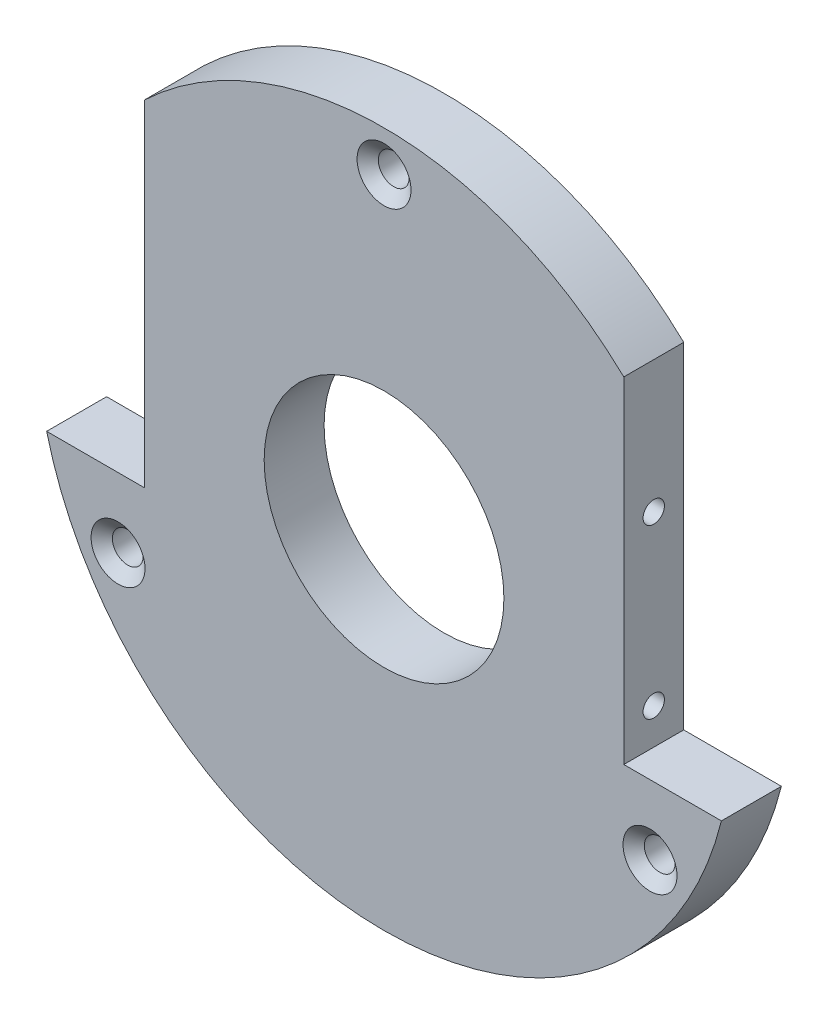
ISO-10303-21;
HEADER;
FILE_DESCRIPTION(('STEP AP214'),'2;1');
FILE_NAME('part.step','',(''),(''),'','','');
FILE_SCHEMA(('AUTOMOTIVE_DESIGN { 1 0 10303 214 1 1 1 1 }'));
ENDSEC;
DATA;
#1=APPLICATION_CONTEXT('core data for automotive mechanical design processes');
#2=APPLICATION_PROTOCOL_DEFINITION('international standard','automotive_design',2000,#1);
#3=PRODUCT_CONTEXT('',#1,'mechanical');
#4=PRODUCT('Part','Part','',(#3));
#5=PRODUCT_RELATED_PRODUCT_CATEGORY('part','',(#4));
#6=PRODUCT_DEFINITION_FORMATION('','',#4);
#7=PRODUCT_DEFINITION_CONTEXT('part definition',#1,'design');
#8=PRODUCT_DEFINITION('design','',#6,#7);
#9=PRODUCT_DEFINITION_SHAPE('','',#8);
#10=(LENGTH_UNIT() NAMED_UNIT(*) SI_UNIT(.MILLI.,.METRE.));
#11=(NAMED_UNIT(*) PLANE_ANGLE_UNIT() SI_UNIT($,.RADIAN.));
#12=(NAMED_UNIT(*) SI_UNIT($,.STERADIAN.) SOLID_ANGLE_UNIT());
#13=UNCERTAINTY_MEASURE_WITH_UNIT(LENGTH_MEASURE(1.E-05),#10,'distance_accuracy_value','');
#14=(GEOMETRIC_REPRESENTATION_CONTEXT(3) GLOBAL_UNCERTAINTY_ASSIGNED_CONTEXT((#13)) GLOBAL_UNIT_ASSIGNED_CONTEXT((#10,
#11,#12)) REPRESENTATION_CONTEXT('',''));
#15=CARTESIAN_POINT('',(0.,0.,0.));
#16=DIRECTION('',(0.,0.,1.));
#17=DIRECTION('',(1.,0.,0.));
#18=AXIS2_PLACEMENT_3D('',#15,#16,#17);
#19=CARTESIAN_POINT('',(0.,0.,6.35));
#20=DIRECTION('',(0.,0.,-1.));
#21=DIRECTION('',(-1.,0.,0.));
#22=AXIS2_PLACEMENT_3D('',#19,#20,#21);
#23=CYLINDRICAL_SURFACE('',#22,36.83);
#24=CARTESIAN_POINT('',(0.,0.,0.));
#25=DIRECTION('',(0.,0.,1.));
#26=DIRECTION('',(1.,0.,0.));
#27=AXIS2_PLACEMENT_3D('',#24,#25,#26);
#28=CIRCLE('',#27,36.83);
#29=CARTESIAN_POINT('',(25.4,26.67,0.));
#30=VERTEX_POINT('',#29);
#31=CARTESIAN_POINT('',(-25.4,26.67,0.));
#32=VERTEX_POINT('',#31);
#33=EDGE_CURVE('E194',#30,#32,#28,.T.);
#34=ORIENTED_EDGE('',*,*,#33,.T.);
#35=DIRECTION('',(0.,0.,-1.));
#36=VECTOR('',#35,1.);
#37=CARTESIAN_POINT('',(-25.4,26.67,6.35));
#38=LINE('',#37,#36);
#39=CARTESIAN_POINT('',(-25.4,26.67,6.35));
#40=VERTEX_POINT('',#39);
#41=EDGE_CURVE('E159',#32,#40,#38,.F.);
#42=ORIENTED_EDGE('',*,*,#41,.T.);
#43=CARTESIAN_POINT('',(0.,0.,6.35));
#44=DIRECTION('',(0.,0.,1.));
#45=DIRECTION('',(1.,0.,0.));
#46=AXIS2_PLACEMENT_3D('',#43,#44,#45);
#47=CIRCLE('',#46,36.83);
#48=CARTESIAN_POINT('',(25.4,26.67,6.35));
#49=VERTEX_POINT('',#48);
#50=EDGE_CURVE('E190',#49,#40,#47,.T.);
#51=ORIENTED_EDGE('',*,*,#50,.F.);
#52=DIRECTION('',(0.,0.,-1.));
#53=VECTOR('',#52,1.);
#54=CARTESIAN_POINT('',(25.4,26.67,6.35));
#55=LINE('',#54,#53);
#56=EDGE_CURVE('E149',#49,#30,#55,.T.);
#57=ORIENTED_EDGE('',*,*,#56,.T.);
#58=EDGE_LOOP('',(#34,#42,#51,#57));
#59=FACE_BOUND('',#58,.T.);
#60=ADVANCED_FACE('F36',(#59),#23,.T.);
#61=CARTESIAN_POINT('',(-35.7409680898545,-8.89,6.35));
#62=VERTEX_POINT('',#61);
#63=CARTESIAN_POINT('',(35.7409680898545,-8.89,6.35));
#64=VERTEX_POINT('',#63);
#65=EDGE_CURVE('E193',#62,#64,#47,.T.);
#66=ORIENTED_EDGE('',*,*,#65,.F.);
#67=DIRECTION('',(0.,0.,-1.));
#68=VECTOR('',#67,1.);
#69=CARTESIAN_POINT('',(-35.7409680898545,-8.89,6.35));
#70=LINE('',#69,#68);
#71=CARTESIAN_POINT('',(-35.7409680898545,-8.89,0.));
#72=VERTEX_POINT('',#71);
#73=EDGE_CURVE('E156',#62,#72,#70,.T.);
#74=ORIENTED_EDGE('',*,*,#73,.T.);
#75=CARTESIAN_POINT('',(35.7409680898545,-8.89,0.));
#76=VERTEX_POINT('',#75);
#77=EDGE_CURVE('E189',#72,#76,#28,.T.);
#78=ORIENTED_EDGE('',*,*,#77,.T.);
#79=DIRECTION('',(0.,0.,-1.));
#80=VECTOR('',#79,1.);
#81=CARTESIAN_POINT('',(35.7409680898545,-8.89,6.35));
#82=LINE('',#81,#80);
#83=EDGE_CURVE('E153',#76,#64,#82,.F.);
#84=ORIENTED_EDGE('',*,*,#83,.T.);
#85=EDGE_LOOP('',(#66,#74,#78,#84));
#86=FACE_BOUND('',#85,.T.);
#87=ADVANCED_FACE('F38',(#86),#23,.T.);
#88=CARTESIAN_POINT('',(0.,0.,6.35));
#89=DIRECTION('',(0.,0.,1.));
#90=DIRECTION('',(1.,0.,0.));
#91=AXIS2_PLACEMENT_3D('',#88,#89,#90);
#92=PLANE('',#91);
#93=CARTESIAN_POINT('',(0.,0.,6.35));
#94=DIRECTION('',(0.,0.,-1.));
#95=DIRECTION('',(-1.,0.,0.));
#96=AXIS2_PLACEMENT_3D('',#93,#94,#95);
#97=CIRCLE('',#96,12.7);
#98=CARTESIAN_POINT('',(-12.7,0.,6.35));
#99=VERTEX_POINT('',#98);
#100=EDGE_CURVE('E118',#99,#99,#97,.T.);
#101=ORIENTED_EDGE('',*,*,#100,.T.);
#102=EDGE_LOOP('',(#101));
#103=FACE_BOUND('',#102,.T.);
#104=DIRECTION('',(0.,1.,0.));
#105=VECTOR('',#104,1.);
#106=CARTESIAN_POINT('',(-25.4,42.9291142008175,6.35));
#107=LINE('',#106,#105);
#108=CARTESIAN_POINT('',(-25.4,-8.89,6.35));
#109=VERTEX_POINT('',#108);
#110=EDGE_CURVE('E136',#109,#40,#107,.T.);
#111=ORIENTED_EDGE('',*,*,#110,.F.);
#112=DIRECTION('',(1.,0.,0.));
#113=VECTOR('',#112,1.);
#114=CARTESIAN_POINT('',(-27.94,-8.89,6.35));
#115=LINE('',#114,#113);
#116=EDGE_CURVE('E138',#62,#109,#115,.T.);
#117=ORIENTED_EDGE('',*,*,#116,.F.);
#118=ORIENTED_EDGE('',*,*,#65,.T.);
#119=DIRECTION('',(1.,0.,0.));
#120=VECTOR('',#119,1.);
#121=CARTESIAN_POINT('',(27.94,-8.89,6.35));
#122=LINE('',#121,#120);
#123=CARTESIAN_POINT('',(25.4,-8.89,6.35));
#124=VERTEX_POINT('',#123);
#125=EDGE_CURVE('E144',#124,#64,#122,.T.);
#126=ORIENTED_EDGE('',*,*,#125,.F.);
#127=DIRECTION('',(0.,-1.,0.));
#128=VECTOR('',#127,1.);
#129=CARTESIAN_POINT('',(25.4,42.9291142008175,6.35));
#130=LINE('',#129,#128);
#131=EDGE_CURVE('E142',#49,#124,#130,.T.);
#132=ORIENTED_EDGE('',*,*,#131,.F.);
#133=ORIENTED_EDGE('',*,*,#50,.T.);
#134=EDGE_LOOP('',(#111,#117,#118,#126,#132,#133));
#135=FACE_BOUND('',#134,.T.);
#136=CARTESIAN_POINT('',(-28.1782149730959,-16.2686999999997,6.35));
#137=DIRECTION('',(0.,0.,1.));
#138=DIRECTION('',(1.,0.,0.));
#139=AXIS2_PLACEMENT_3D('',#136,#137,#138);
#140=CIRCLE('',#139,2.8575);
#141=CARTESIAN_POINT('',(-25.3207149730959,-16.2686999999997,6.35));
#142=VERTEX_POINT('',#141);
#143=EDGE_CURVE('E162',#142,#142,#140,.T.);
#144=ORIENTED_EDGE('',*,*,#143,.F.);
#145=EDGE_LOOP('',(#144));
#146=FACE_BOUND('',#145,.T.);
#147=CARTESIAN_POINT('',(28.1782149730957,-16.2687000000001,6.35));
#148=DIRECTION('',(0.,0.,1.));
#149=DIRECTION('',(1.,0.,0.));
#150=AXIS2_PLACEMENT_3D('',#147,#148,#149);
#151=CIRCLE('',#150,2.8575);
#152=CARTESIAN_POINT('',(31.0357149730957,-16.2687000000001,6.35));
#153=VERTEX_POINT('',#152);
#154=EDGE_CURVE('E171',#153,#153,#151,.T.);
#155=ORIENTED_EDGE('',*,*,#154,.F.);
#156=EDGE_LOOP('',(#155));
#157=FACE_BOUND('',#156,.T.);
#158=CARTESIAN_POINT('',(0.,32.5374,6.35));
#159=DIRECTION('',(0.,0.,1.));
#160=DIRECTION('',(1.,0.,0.));
#161=AXIS2_PLACEMENT_3D('',#158,#159,#160);
#162=CIRCLE('',#161,2.8575);
#163=CARTESIAN_POINT('',(2.8575,32.5374,6.35));
#164=VERTEX_POINT('',#163);
#165=EDGE_CURVE('E180',#164,#164,#162,.T.);
#166=ORIENTED_EDGE('',*,*,#165,.F.);
#167=EDGE_LOOP('',(#166));
#168=FACE_BOUND('',#167,.T.);
#169=ADVANCED_FACE('F209',(#103,#135,#146,#157,#168),#92,.T.);
#170=CARTESIAN_POINT('',(0.,0.,0.));
#171=DIRECTION('',(0.,0.,1.));
#172=DIRECTION('',(1.,0.,0.));
#173=AXIS2_PLACEMENT_3D('',#170,#171,#172);
#174=PLANE('',#173);
#175=CARTESIAN_POINT('',(0.,0.,0.));
#176=DIRECTION('',(0.,0.,-1.));
#177=DIRECTION('',(-1.,0.,0.));
#178=AXIS2_PLACEMENT_3D('',#175,#176,#177);
#179=CIRCLE('',#178,12.7);
#180=CARTESIAN_POINT('',(-12.7,0.,0.));
#181=VERTEX_POINT('',#180);
#182=EDGE_CURVE('E323',#181,#181,#179,.T.);
#183=ORIENTED_EDGE('',*,*,#182,.F.);
#184=EDGE_LOOP('',(#183));
#185=FACE_BOUND('',#184,.T.);
#186=CARTESIAN_POINT('',(-28.1782149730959,-16.2686999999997,0.));
#187=DIRECTION('',(0.,0.,1.));
#188=DIRECTION('',(1.,0.,0.));
#189=AXIS2_PLACEMENT_3D('',#186,#187,#188);
#190=CIRCLE('',#189,1.63195);
#191=CARTESIAN_POINT('',(-26.5462649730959,-16.2686999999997,0.));
#192=VERTEX_POINT('',#191);
#193=EDGE_CURVE('E168',#192,#192,#190,.T.);
#194=ORIENTED_EDGE('',*,*,#193,.T.);
#195=EDGE_LOOP('',(#194));
#196=FACE_BOUND('',#195,.T.);
#197=CARTESIAN_POINT('',(28.1782149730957,-16.2687000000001,0.));
#198=DIRECTION('',(0.,0.,1.));
#199=DIRECTION('',(1.,0.,0.));
#200=AXIS2_PLACEMENT_3D('',#197,#198,#199);
#201=CIRCLE('',#200,1.63195);
#202=CARTESIAN_POINT('',(29.8101649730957,-16.2687000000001,0.));
#203=VERTEX_POINT('',#202);
#204=EDGE_CURVE('E177',#203,#203,#201,.T.);
#205=ORIENTED_EDGE('',*,*,#204,.T.);
#206=EDGE_LOOP('',(#205));
#207=FACE_BOUND('',#206,.T.);
#208=CARTESIAN_POINT('',(0.,32.5374,0.));
#209=DIRECTION('',(0.,0.,1.));
#210=DIRECTION('',(1.,0.,0.));
#211=AXIS2_PLACEMENT_3D('',#208,#209,#210);
#212=CIRCLE('',#211,1.63195);
#213=CARTESIAN_POINT('',(1.63195,32.5374,0.));
#214=VERTEX_POINT('',#213);
#215=EDGE_CURVE('E186',#214,#214,#212,.T.);
#216=ORIENTED_EDGE('',*,*,#215,.T.);
#217=EDGE_LOOP('',(#216));
#218=FACE_BOUND('',#217,.T.);
#219=DIRECTION('',(1.,0.,0.));
#220=VECTOR('',#219,1.);
#221=CARTESIAN_POINT('',(0.,-8.89,0.));
#222=LINE('',#221,#220);
#223=CARTESIAN_POINT('',(-25.4,-8.89,0.));
#224=VERTEX_POINT('',#223);
#225=EDGE_CURVE('E11',#72,#224,#222,.T.);
#226=ORIENTED_EDGE('',*,*,#225,.T.);
#227=DIRECTION('',(0.,1.,0.));
#228=VECTOR('',#227,1.);
#229=CARTESIAN_POINT('',(-25.4,42.9291142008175,0.));
#230=LINE('',#229,#228);
#231=EDGE_CURVE('E51',#224,#32,#230,.T.);
#232=ORIENTED_EDGE('',*,*,#231,.T.);
#233=ORIENTED_EDGE('',*,*,#33,.F.);
#234=DIRECTION('',(0.,-1.,0.));
#235=VECTOR('',#234,1.);
#236=CARTESIAN_POINT('',(25.4,0.,0.));
#237=LINE('',#236,#235);
#238=CARTESIAN_POINT('',(25.4,-8.89,0.));
#239=VERTEX_POINT('',#238);
#240=EDGE_CURVE('E44',#30,#239,#237,.T.);
#241=ORIENTED_EDGE('',*,*,#240,.T.);
#242=DIRECTION('',(1.,0.,0.));
#243=VECTOR('',#242,1.);
#244=CARTESIAN_POINT('',(27.94,-8.89,0.));
#245=LINE('',#244,#243);
#246=EDGE_CURVE('E59',#239,#76,#245,.T.);
#247=ORIENTED_EDGE('',*,*,#246,.T.);
#248=ORIENTED_EDGE('',*,*,#77,.F.);
#249=EDGE_LOOP('',(#226,#232,#233,#241,#247,#248));
#250=FACE_BOUND('',#249,.T.);
#251=ADVANCED_FACE('F199',(#185,#196,#207,#218,#250),#174,.F.);
#252=CARTESIAN_POINT('',(0.,32.5374,6.35));
#253=DIRECTION('',(0.,0.,1.));
#254=DIRECTION('',(1.,0.,0.));
#255=AXIS2_PLACEMENT_3D('',#252,#253,#254);
#256=CYLINDRICAL_SURFACE('',#255,1.63195);
#257=ORIENTED_EDGE('',*,*,#215,.F.);
#258=EDGE_LOOP('',(#257));
#259=FACE_BOUND('',#258,.T.);
#260=CARTESIAN_POINT('',(0.,32.5374,5.32164144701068));
#261=DIRECTION('',(0.,0.,1.));
#262=DIRECTION('',(1.,0.,0.));
#263=AXIS2_PLACEMENT_3D('',#260,#261,#262);
#264=CIRCLE('',#263,1.63195);
#265=CARTESIAN_POINT('',(1.63195,32.5374,5.32164144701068));
#266=VERTEX_POINT('',#265);
#267=EDGE_CURVE('E183',#266,#266,#264,.T.);
#268=ORIENTED_EDGE('',*,*,#267,.T.);
#269=EDGE_LOOP('',(#268));
#270=FACE_BOUND('',#269,.T.);
#271=ADVANCED_FACE('F246',(#259,#270),#256,.F.);
#272=CARTESIAN_POINT('',(0.,32.5374,6.35));
#273=DIRECTION('',(0.,0.,1.));
#274=DIRECTION('',(1.,0.,0.));
#275=AXIS2_PLACEMENT_3D('',#272,#273,#274);
#276=CONICAL_SURFACE('',#275,2.8575,0.872664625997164);
#277=ORIENTED_EDGE('',*,*,#267,.F.);
#278=EDGE_LOOP('',(#277));
#279=FACE_BOUND('',#278,.T.);
#280=ORIENTED_EDGE('',*,*,#165,.T.);
#281=EDGE_LOOP('',(#280));
#282=FACE_BOUND('',#281,.T.);
#283=ADVANCED_FACE('F252',(#279,#282),#276,.F.);
#284=CARTESIAN_POINT('',(28.1782149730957,-16.2687000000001,6.35));
#285=DIRECTION('',(0.,0.,1.));
#286=DIRECTION('',(1.,0.,0.));
#287=AXIS2_PLACEMENT_3D('',#284,#285,#286);
#288=CYLINDRICAL_SURFACE('',#287,1.63195);
#289=ORIENTED_EDGE('',*,*,#204,.F.);
#290=EDGE_LOOP('',(#289));
#291=FACE_BOUND('',#290,.T.);
#292=CARTESIAN_POINT('',(28.1782149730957,-16.2687000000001,5.32164144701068));
#293=DIRECTION('',(0.,0.,1.));
#294=DIRECTION('',(1.,0.,0.));
#295=AXIS2_PLACEMENT_3D('',#292,#293,#294);
#296=CIRCLE('',#295,1.63195);
#297=CARTESIAN_POINT('',(29.8101649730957,-16.2687000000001,5.32164144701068));
#298=VERTEX_POINT('',#297);
#299=EDGE_CURVE('E174',#298,#298,#296,.T.);
#300=ORIENTED_EDGE('',*,*,#299,.T.);
#301=EDGE_LOOP('',(#300));
#302=FACE_BOUND('',#301,.T.);
#303=ADVANCED_FACE('F256',(#291,#302),#288,.F.);
#304=CARTESIAN_POINT('',(28.1782149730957,-16.2687000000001,6.35));
#305=DIRECTION('',(0.,0.,1.));
#306=DIRECTION('',(1.,0.,0.));
#307=AXIS2_PLACEMENT_3D('',#304,#305,#306);
#308=CONICAL_SURFACE('',#307,2.8575,0.872664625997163);
#309=ORIENTED_EDGE('',*,*,#299,.F.);
#310=EDGE_LOOP('',(#309));
#311=FACE_BOUND('',#310,.T.);
#312=ORIENTED_EDGE('',*,*,#154,.T.);
#313=EDGE_LOOP('',(#312));
#314=FACE_BOUND('',#313,.T.);
#315=ADVANCED_FACE('F260',(#311,#314),#308,.F.);
#316=CARTESIAN_POINT('',(-28.1782149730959,-16.2686999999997,6.35));
#317=DIRECTION('',(0.,0.,1.));
#318=DIRECTION('',(1.,0.,0.));
#319=AXIS2_PLACEMENT_3D('',#316,#317,#318);
#320=CYLINDRICAL_SURFACE('',#319,1.63195);
#321=ORIENTED_EDGE('',*,*,#193,.F.);
#322=EDGE_LOOP('',(#321));
#323=FACE_BOUND('',#322,.T.);
#324=CARTESIAN_POINT('',(-28.1782149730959,-16.2686999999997,5.32164144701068));
#325=DIRECTION('',(0.,0.,1.));
#326=DIRECTION('',(1.,0.,0.));
#327=AXIS2_PLACEMENT_3D('',#324,#325,#326);
#328=CIRCLE('',#327,1.63195);
#329=CARTESIAN_POINT('',(-26.5462649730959,-16.2686999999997,5.32164144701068));
#330=VERTEX_POINT('',#329);
#331=EDGE_CURVE('E165',#330,#330,#328,.T.);
#332=ORIENTED_EDGE('',*,*,#331,.T.);
#333=EDGE_LOOP('',(#332));
#334=FACE_BOUND('',#333,.T.);
#335=ADVANCED_FACE('F264',(#323,#334),#320,.F.);
#336=CARTESIAN_POINT('',(-28.1782149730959,-16.2686999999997,6.35));
#337=DIRECTION('',(0.,0.,1.));
#338=DIRECTION('',(1.,0.,0.));
#339=AXIS2_PLACEMENT_3D('',#336,#337,#338);
#340=CONICAL_SURFACE('',#339,2.8575,0.872664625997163);
#341=ORIENTED_EDGE('',*,*,#331,.F.);
#342=EDGE_LOOP('',(#341));
#343=FACE_BOUND('',#342,.T.);
#344=ORIENTED_EDGE('',*,*,#143,.T.);
#345=EDGE_LOOP('',(#344));
#346=FACE_BOUND('',#345,.T.);
#347=ADVANCED_FACE('F267',(#343,#346),#340,.F.);
#348=CARTESIAN_POINT('',(25.4,42.9291142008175,0.));
#349=DIRECTION('',(-1.,0.,0.));
#350=DIRECTION('',(0.,-1.,0.));
#351=AXIS2_PLACEMENT_3D('',#348,#349,#350);
#352=PLANE('',#351);
#353=CARTESIAN_POINT('',(25.4,-5.08,3.175));
#354=DIRECTION('',(1.,0.,0.));
#355=DIRECTION('',(0.,0.,-1.));
#356=AXIS2_PLACEMENT_3D('',#353,#354,#355);
#357=CIRCLE('',#356,1.13029999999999);
#358=CARTESIAN_POINT('',(25.4,-5.08,2.04470000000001));
#359=VERTEX_POINT('',#358);
#360=EDGE_CURVE('E112',#359,#359,#357,.T.);
#361=ORIENTED_EDGE('',*,*,#360,.F.);
#362=EDGE_LOOP('',(#361));
#363=FACE_BOUND('',#362,.T.);
#364=CARTESIAN_POINT('',(25.4,12.7,3.175));
#365=DIRECTION('',(1.,0.,0.));
#366=DIRECTION('',(0.,0.,-1.));
#367=AXIS2_PLACEMENT_3D('',#364,#365,#366);
#368=CIRCLE('',#367,1.13029999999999);
#369=CARTESIAN_POINT('',(25.4,12.7,2.04470000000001));
#370=VERTEX_POINT('',#369);
#371=EDGE_CURVE('E111',#370,#370,#368,.T.);
#372=ORIENTED_EDGE('',*,*,#371,.F.);
#373=EDGE_LOOP('',(#372));
#374=FACE_BOUND('',#373,.T.);
#375=ORIENTED_EDGE('',*,*,#131,.T.);
#376=DIRECTION('',(0.,0.,1.));
#377=VECTOR('',#376,1.);
#378=CARTESIAN_POINT('',(25.4,-8.89,0.));
#379=LINE('',#378,#377);
#380=EDGE_CURVE('E140',#239,#124,#379,.T.);
#381=ORIENTED_EDGE('',*,*,#380,.F.);
#382=ORIENTED_EDGE('',*,*,#240,.F.);
#383=ORIENTED_EDGE('',*,*,#56,.F.);
#384=EDGE_LOOP('',(#375,#381,#382,#383));
#385=FACE_BOUND('',#384,.T.);
#386=ADVANCED_FACE('F203',(#363,#374,#385),#352,.F.);
#387=CARTESIAN_POINT('',(27.94,-8.89,0.));
#388=DIRECTION('',(0.,-1.,0.));
#389=DIRECTION('',(0.,0.,-1.));
#390=AXIS2_PLACEMENT_3D('',#387,#388,#389);
#391=PLANE('',#390);
#392=ORIENTED_EDGE('',*,*,#246,.F.);
#393=ORIENTED_EDGE('',*,*,#380,.T.);
#394=ORIENTED_EDGE('',*,*,#125,.T.);
#395=ORIENTED_EDGE('',*,*,#83,.F.);
#396=EDGE_LOOP('',(#392,#393,#394,#395));
#397=FACE_BOUND('',#396,.T.);
#398=ADVANCED_FACE('F214',(#397),#391,.F.);
#399=CARTESIAN_POINT('',(-25.4,42.9291142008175,0.));
#400=DIRECTION('',(1.,0.,0.));
#401=DIRECTION('',(0.,1.,0.));
#402=AXIS2_PLACEMENT_3D('',#399,#400,#401);
#403=PLANE('',#402);
#404=CARTESIAN_POINT('',(-25.4,-5.08,3.175));
#405=DIRECTION('',(-1.,0.,0.));
#406=DIRECTION('',(0.,0.,1.));
#407=AXIS2_PLACEMENT_3D('',#404,#405,#406);
#408=CIRCLE('',#407,1.13029999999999);
#409=CARTESIAN_POINT('',(-25.4,-5.08,4.30529999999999));
#410=VERTEX_POINT('',#409);
#411=EDGE_CURVE('E124',#410,#410,#408,.T.);
#412=ORIENTED_EDGE('',*,*,#411,.F.);
#413=EDGE_LOOP('',(#412));
#414=FACE_BOUND('',#413,.T.);
#415=CARTESIAN_POINT('',(-25.4,12.7,3.175));
#416=DIRECTION('',(-1.,0.,0.));
#417=DIRECTION('',(0.,0.,1.));
#418=AXIS2_PLACEMENT_3D('',#415,#416,#417);
#419=CIRCLE('',#418,1.13029999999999);
#420=CARTESIAN_POINT('',(-25.4,12.7,4.30529999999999));
#421=VERTEX_POINT('',#420);
#422=EDGE_CURVE('E130',#421,#421,#419,.T.);
#423=ORIENTED_EDGE('',*,*,#422,.F.);
#424=EDGE_LOOP('',(#423));
#425=FACE_BOUND('',#424,.T.);
#426=ORIENTED_EDGE('',*,*,#231,.F.);
#427=DIRECTION('',(0.,0.,1.));
#428=VECTOR('',#427,1.);
#429=CARTESIAN_POINT('',(-25.4,-8.89,0.));
#430=LINE('',#429,#428);
#431=EDGE_CURVE('E147',#224,#109,#430,.T.);
#432=ORIENTED_EDGE('',*,*,#431,.T.);
#433=ORIENTED_EDGE('',*,*,#110,.T.);
#434=ORIENTED_EDGE('',*,*,#41,.F.);
#435=EDGE_LOOP('',(#426,#432,#433,#434));
#436=FACE_BOUND('',#435,.T.);
#437=ADVANCED_FACE('F219',(#414,#425,#436),#403,.F.);
#438=CARTESIAN_POINT('',(-27.94,-8.89,0.));
#439=DIRECTION('',(0.,-1.,0.));
#440=DIRECTION('',(0.,0.,-1.));
#441=AXIS2_PLACEMENT_3D('',#438,#439,#440);
#442=PLANE('',#441);
#443=ORIENTED_EDGE('',*,*,#116,.T.);
#444=ORIENTED_EDGE('',*,*,#431,.F.);
#445=ORIENTED_EDGE('',*,*,#225,.F.);
#446=ORIENTED_EDGE('',*,*,#73,.F.);
#447=EDGE_LOOP('',(#443,#444,#445,#446));
#448=FACE_BOUND('',#447,.T.);
#449=ADVANCED_FACE('F218',(#448),#442,.F.);
#450=CARTESIAN_POINT('',(-13.97,12.7,3.175));
#451=DIRECTION('',(-1.,0.,0.));
#452=DIRECTION('',(0.,0.,1.));
#453=AXIS2_PLACEMENT_3D('',#450,#451,#452);
#454=CONICAL_SURFACE('',#453,1.1303,1.02974425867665);
#455=CARTESIAN_POINT('',(-13.2908472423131,12.7,3.175));
#456=VERTEX_POINT('',#455);
#457=VERTEX_LOOP('',#456);
#458=FACE_BOUND('',#457,.T.);
#459=CARTESIAN_POINT('',(-13.97,12.7,3.175));
#460=DIRECTION('',(-1.,0.,0.));
#461=DIRECTION('',(0.,0.,1.));
#462=AXIS2_PLACEMENT_3D('',#459,#460,#461);
#463=CIRCLE('',#462,1.1303);
#464=CARTESIAN_POINT('',(-13.97,12.7,4.3053));
#465=VERTEX_POINT('',#464);
#466=EDGE_CURVE('E133',#465,#465,#463,.T.);
#467=ORIENTED_EDGE('',*,*,#466,.T.);
#468=EDGE_LOOP('',(#467));
#469=FACE_BOUND('',#468,.T.);
#470=ADVANCED_FACE('F227',(#458,#469),#454,.F.);
#471=CARTESIAN_POINT('',(-25.4,12.7,3.175));
#472=DIRECTION('',(-1.,0.,0.));
#473=DIRECTION('',(0.,0.,1.));
#474=AXIS2_PLACEMENT_3D('',#471,#472,#473);
#475=CYLINDRICAL_SURFACE('',#474,1.13029999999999);
#476=ORIENTED_EDGE('',*,*,#466,.F.);
#477=EDGE_LOOP('',(#476));
#478=FACE_BOUND('',#477,.T.);
#479=ORIENTED_EDGE('',*,*,#422,.T.);
#480=EDGE_LOOP('',(#479));
#481=FACE_BOUND('',#480,.T.);
#482=ADVANCED_FACE('F292',(#478,#481),#475,.F.);
#483=CARTESIAN_POINT('',(-13.97,-5.08,3.175));
#484=DIRECTION('',(-1.,0.,0.));
#485=DIRECTION('',(0.,0.,1.));
#486=AXIS2_PLACEMENT_3D('',#483,#484,#485);
#487=CONICAL_SURFACE('',#486,1.1303,1.02974425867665);
#488=CARTESIAN_POINT('',(-13.2908472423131,-5.08000000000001,3.175));
#489=VERTEX_POINT('',#488);
#490=VERTEX_LOOP('',#489);
#491=FACE_BOUND('',#490,.T.);
#492=CARTESIAN_POINT('',(-13.97,-5.08,3.175));
#493=DIRECTION('',(-1.,0.,0.));
#494=DIRECTION('',(0.,0.,1.));
#495=AXIS2_PLACEMENT_3D('',#492,#493,#494);
#496=CIRCLE('',#495,1.1303);
#497=CARTESIAN_POINT('',(-13.97,-5.08,4.3053));
#498=VERTEX_POINT('',#497);
#499=EDGE_CURVE('E127',#498,#498,#496,.T.);
#500=ORIENTED_EDGE('',*,*,#499,.T.);
#501=EDGE_LOOP('',(#500));
#502=FACE_BOUND('',#501,.T.);
#503=ADVANCED_FACE('F296',(#491,#502),#487,.F.);
#504=CARTESIAN_POINT('',(-25.4,-5.08,3.175));
#505=DIRECTION('',(-1.,0.,0.));
#506=DIRECTION('',(0.,0.,1.));
#507=AXIS2_PLACEMENT_3D('',#504,#505,#506);
#508=CYLINDRICAL_SURFACE('',#507,1.13029999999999);
#509=ORIENTED_EDGE('',*,*,#499,.F.);
#510=EDGE_LOOP('',(#509));
#511=FACE_BOUND('',#510,.T.);
#512=ORIENTED_EDGE('',*,*,#411,.T.);
#513=EDGE_LOOP('',(#512));
#514=FACE_BOUND('',#513,.T.);
#515=ADVANCED_FACE('F300',(#511,#514),#508,.F.);
#516=CARTESIAN_POINT('',(13.97,12.7,3.175));
#517=DIRECTION('',(1.,0.,0.));
#518=DIRECTION('',(0.,0.,-1.));
#519=AXIS2_PLACEMENT_3D('',#516,#517,#518);
#520=CONICAL_SURFACE('',#519,1.1303,1.02974425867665);
#521=CARTESIAN_POINT('',(13.2908472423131,12.7,3.175));
#522=VERTEX_POINT('',#521);
#523=VERTEX_LOOP('',#522);
#524=FACE_BOUND('',#523,.T.);
#525=CARTESIAN_POINT('',(13.97,12.7,3.175));
#526=DIRECTION('',(1.,0.,0.));
#527=DIRECTION('',(0.,0.,-1.));
#528=AXIS2_PLACEMENT_3D('',#525,#526,#527);
#529=CIRCLE('',#528,1.1303);
#530=CARTESIAN_POINT('',(13.97,12.7,2.0447));
#531=VERTEX_POINT('',#530);
#532=EDGE_CURVE('E115',#531,#531,#529,.T.);
#533=ORIENTED_EDGE('',*,*,#532,.T.);
#534=EDGE_LOOP('',(#533));
#535=FACE_BOUND('',#534,.T.);
#536=ADVANCED_FACE('F304',(#524,#535),#520,.F.);
#537=CARTESIAN_POINT('',(25.4,12.7,3.175));
#538=DIRECTION('',(1.,0.,0.));
#539=DIRECTION('',(0.,0.,-1.));
#540=AXIS2_PLACEMENT_3D('',#537,#538,#539);
#541=CYLINDRICAL_SURFACE('',#540,1.13029999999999);
#542=ORIENTED_EDGE('',*,*,#532,.F.);
#543=EDGE_LOOP('',(#542));
#544=FACE_BOUND('',#543,.T.);
#545=ORIENTED_EDGE('',*,*,#371,.T.);
#546=EDGE_LOOP('',(#545));
#547=FACE_BOUND('',#546,.T.);
#548=ADVANCED_FACE('F105',(#544,#547),#541,.F.);
#549=CARTESIAN_POINT('',(13.97,-5.08,3.175));
#550=DIRECTION('',(1.,0.,0.));
#551=DIRECTION('',(0.,0.,-1.));
#552=AXIS2_PLACEMENT_3D('',#549,#550,#551);
#553=CONICAL_SURFACE('',#552,1.1303,1.02974425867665);
#554=CARTESIAN_POINT('',(13.2908472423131,-5.08000000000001,3.175));
#555=VERTEX_POINT('',#554);
#556=VERTEX_LOOP('',#555);
#557=FACE_BOUND('',#556,.T.);
#558=CARTESIAN_POINT('',(13.97,-5.08,3.175));
#559=DIRECTION('',(1.,0.,0.));
#560=DIRECTION('',(0.,0.,-1.));
#561=AXIS2_PLACEMENT_3D('',#558,#559,#560);
#562=CIRCLE('',#561,1.1303);
#563=CARTESIAN_POINT('',(13.97,-5.08,2.0447));
#564=VERTEX_POINT('',#563);
#565=EDGE_CURVE('E109',#564,#564,#562,.T.);
#566=ORIENTED_EDGE('',*,*,#565,.T.);
#567=EDGE_LOOP('',(#566));
#568=FACE_BOUND('',#567,.T.);
#569=ADVANCED_FACE('F101',(#557,#568),#553,.F.);
#570=CARTESIAN_POINT('',(25.4,-5.08,3.175));
#571=DIRECTION('',(1.,0.,0.));
#572=DIRECTION('',(0.,0.,-1.));
#573=AXIS2_PLACEMENT_3D('',#570,#571,#572);
#574=CYLINDRICAL_SURFACE('',#573,1.13029999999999);
#575=ORIENTED_EDGE('',*,*,#565,.F.);
#576=EDGE_LOOP('',(#575));
#577=FACE_BOUND('',#576,.T.);
#578=ORIENTED_EDGE('',*,*,#360,.T.);
#579=EDGE_LOOP('',(#578));
#580=FACE_BOUND('',#579,.T.);
#581=ADVANCED_FACE('F104',(#577,#580),#574,.F.);
#582=CARTESIAN_POINT('',(0.,0.,6.35));
#583=DIRECTION('',(0.,0.,-1.));
#584=DIRECTION('',(-1.,0.,0.));
#585=AXIS2_PLACEMENT_3D('',#582,#583,#584);
#586=CYLINDRICAL_SURFACE('',#585,12.7);
#587=ORIENTED_EDGE('',*,*,#100,.F.);
#588=EDGE_LOOP('',(#587));
#589=FACE_BOUND('',#588,.T.);
#590=ORIENTED_EDGE('',*,*,#182,.T.);
#591=EDGE_LOOP('',(#590));
#592=FACE_BOUND('',#591,.T.);
#593=ADVANCED_FACE('F314',(#589,#592),#586,.F.);
#594=CLOSED_SHELL('',(#60,#87,#169,#251,#271,#283,#303,#315,#335,#347,#386,#398,#437,#449,#470,
#482,#503,#515,#536,#548,#569,#581,#593));
#595=MANIFOLD_SOLID_BREP('B2',#594);
#596=ADVANCED_BREP_SHAPE_REPRESENTATION('',(#18,#595),#14);
#597=SHAPE_DEFINITION_REPRESENTATION(#9,#596);
ENDSEC;
END-ISO-10303-21;
